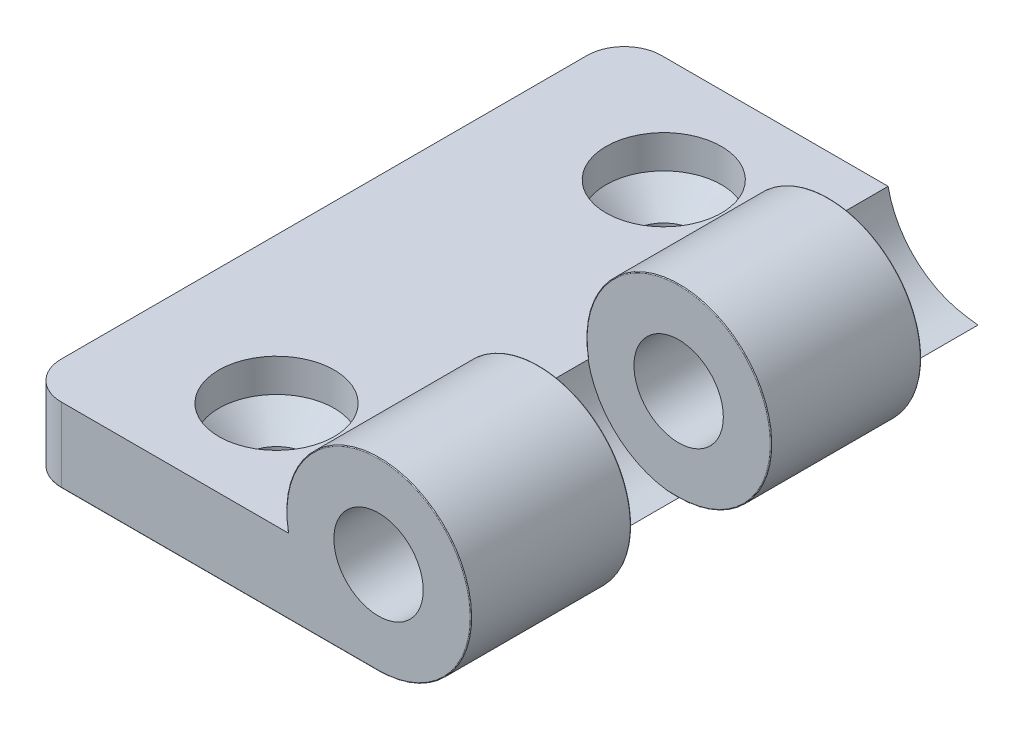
ISO-10303-21;
HEADER;
FILE_DESCRIPTION(('STEP AP214'),'2;1');
FILE_NAME('part.step','',(''),(''),'','','');
FILE_SCHEMA(('AUTOMOTIVE_DESIGN { 1 0 10303 214 1 1 1 1 }'));
ENDSEC;
DATA;
#1=APPLICATION_CONTEXT('core data for automotive mechanical design processes');
#2=APPLICATION_PROTOCOL_DEFINITION('international standard','automotive_design',2000,#1);
#3=PRODUCT_CONTEXT('',#1,'mechanical');
#4=PRODUCT('Part','Part','',(#3));
#5=PRODUCT_RELATED_PRODUCT_CATEGORY('part','',(#4));
#6=PRODUCT_DEFINITION_FORMATION('','',#4);
#7=PRODUCT_DEFINITION_CONTEXT('part definition',#1,'design');
#8=PRODUCT_DEFINITION('design','',#6,#7);
#9=PRODUCT_DEFINITION_SHAPE('','',#8);
#10=(LENGTH_UNIT() NAMED_UNIT(*) SI_UNIT(.MILLI.,.METRE.));
#11=(NAMED_UNIT(*) PLANE_ANGLE_UNIT() SI_UNIT($,.RADIAN.));
#12=(NAMED_UNIT(*) SI_UNIT($,.STERADIAN.) SOLID_ANGLE_UNIT());
#13=UNCERTAINTY_MEASURE_WITH_UNIT(LENGTH_MEASURE(1.E-05),#10,'distance_accuracy_value','');
#14=(GEOMETRIC_REPRESENTATION_CONTEXT(3) GLOBAL_UNCERTAINTY_ASSIGNED_CONTEXT((#13)) GLOBAL_UNIT_ASSIGNED_CONTEXT((#10,
#11,#12)) REPRESENTATION_CONTEXT('',''));
#15=CARTESIAN_POINT('',(0.,0.,0.));
#16=DIRECTION('',(0.,0.,1.));
#17=DIRECTION('',(1.,0.,0.));
#18=AXIS2_PLACEMENT_3D('',#15,#16,#17);
#19=CARTESIAN_POINT('',(0.,0.,40.3));
#20=DIRECTION('',(0.,0.,-1.));
#21=DIRECTION('',(-1.,0.,0.));
#22=AXIS2_PLACEMENT_3D('',#19,#20,#21);
#23=CYLINDRICAL_SURFACE('',#22,6.2);
#24=DIRECTION('',(0.,0.,-1.));
#25=VECTOR('',#24,1.);
#26=CARTESIAN_POINT('',(0.,-6.2,40.3));
#27=LINE('',#26,#25);
#28=CARTESIAN_POINT('',(0.,-6.2,20.1));
#29=VERTEX_POINT('',#28);
#30=CARTESIAN_POINT('',(0.,-6.2,10.125));
#31=VERTEX_POINT('',#30);
#32=EDGE_CURVE('E237',#29,#31,#27,.T.);
#33=ORIENTED_EDGE('',*,*,#32,.T.);
#34=CARTESIAN_POINT('',(0.,0.,10.125));
#35=DIRECTION('',(0.,0.,1.));
#36=DIRECTION('',(1.,0.,0.));
#37=AXIS2_PLACEMENT_3D('',#34,#35,#36);
#38=CIRCLE('',#37,6.2);
#39=CARTESIAN_POINT('',(-6.08276253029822,-1.2,10.125));
#40=VERTEX_POINT('',#39);
#41=EDGE_CURVE('E319',#31,#40,#38,.T.);
#42=ORIENTED_EDGE('',*,*,#41,.T.);
#43=DIRECTION('',(0.,0.,-1.));
#44=VECTOR('',#43,1.);
#45=CARTESIAN_POINT('',(-6.08276253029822,-1.2,40.3));
#46=LINE('',#45,#44);
#47=CARTESIAN_POINT('',(-6.08276253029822,-1.2,20.1));
#48=VERTEX_POINT('',#47);
#49=EDGE_CURVE('E240',#48,#40,#46,.T.);
#50=ORIENTED_EDGE('',*,*,#49,.F.);
#51=CARTESIAN_POINT('',(0.,0.,20.1));
#52=DIRECTION('',(0.,0.,1.));
#53=DIRECTION('',(1.,0.,0.));
#54=AXIS2_PLACEMENT_3D('',#51,#52,#53);
#55=CIRCLE('',#54,6.2);
#56=EDGE_CURVE('E471',#48,#29,#55,.F.);
#57=ORIENTED_EDGE('',*,*,#56,.T.);
#58=EDGE_LOOP('',(#33,#42,#50,#57));
#59=FACE_BOUND('',#58,.T.);
#60=ADVANCED_FACE('F38',(#59),#23,.T.);
#61=CARTESIAN_POINT('',(0.,0.,40.3));
#62=DIRECTION('',(0.,0.,-1.));
#63=DIRECTION('',(-1.,0.,0.));
#64=AXIS2_PLACEMENT_3D('',#61,#62,#63);
#65=CYLINDRICAL_SURFACE('',#64,3.);
#66=CARTESIAN_POINT('',(0.,0.,10.075));
#67=DIRECTION('',(0.,0.,1.));
#68=DIRECTION('',(1.,0.,0.));
#69=AXIS2_PLACEMENT_3D('',#66,#67,#68);
#70=CIRCLE('',#69,3.);
#71=CARTESIAN_POINT('',(3.,0.,10.075));
#72=VERTEX_POINT('',#71);
#73=EDGE_CURVE('E208',#72,#72,#70,.T.);
#74=ORIENTED_EDGE('',*,*,#73,.F.);
#75=EDGE_LOOP('',(#74));
#76=FACE_BOUND('',#75,.T.);
#77=CARTESIAN_POINT('',(0.,0.,20.15));
#78=DIRECTION('',(0.,0.,1.));
#79=DIRECTION('',(1.,0.,0.));
#80=AXIS2_PLACEMENT_3D('',#77,#78,#79);
#81=CIRCLE('',#80,3.);
#82=CARTESIAN_POINT('',(3.,0.,20.15));
#83=VERTEX_POINT('',#82);
#84=EDGE_CURVE('E203',#83,#83,#81,.T.);
#85=ORIENTED_EDGE('',*,*,#84,.T.);
#86=EDGE_LOOP('',(#85));
#87=FACE_BOUND('',#86,.T.);
#88=ADVANCED_FACE('F394',(#76,#87),#65,.F.);
#89=CARTESIAN_POINT('',(0.,0.,0.));
#90=DIRECTION('',(0.,0.,1.));
#91=DIRECTION('',(1.,0.,0.));
#92=AXIS2_PLACEMENT_3D('',#89,#90,#91);
#93=PLANE('',#92);
#94=CARTESIAN_POINT('',(0.,0.,0.));
#95=DIRECTION('',(0.,0.,1.));
#96=DIRECTION('',(1.,0.,0.));
#97=AXIS2_PLACEMENT_3D('',#94,#95,#96);
#98=CIRCLE('',#97,6.2);
#99=CARTESIAN_POINT('',(-6.08276253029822,-1.2,0.));
#100=VERTEX_POINT('',#99);
#101=CARTESIAN_POINT('',(-0.785811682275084,-6.15,0.));
#102=VERTEX_POINT('',#101);
#103=EDGE_CURVE('E196',#100,#102,#98,.T.);
#104=ORIENTED_EDGE('',*,*,#103,.T.);
#105=DIRECTION('',(1.,0.,0.));
#106=VECTOR('',#105,1.);
#107=CARTESIAN_POINT('',(0.,-6.15,0.));
#108=LINE('',#107,#106);
#109=CARTESIAN_POINT('',(-21.3,-6.15,0.));
#110=VERTEX_POINT('',#109);
#111=EDGE_CURVE('E362',#102,#110,#108,.F.);
#112=ORIENTED_EDGE('',*,*,#111,.T.);
#113=DIRECTION('',(0.,-1.,0.));
#114=VECTOR('',#113,1.);
#115=CARTESIAN_POINT('',(-21.3,0.,0.));
#116=LINE('',#115,#114);
#117=CARTESIAN_POINT('',(-21.3,-1.2,0.));
#118=VERTEX_POINT('',#117);
#119=EDGE_CURVE('E267',#110,#118,#116,.F.);
#120=ORIENTED_EDGE('',*,*,#119,.T.);
#121=DIRECTION('',(-1.,0.,0.));
#122=VECTOR('',#121,1.);
#123=CARTESIAN_POINT('',(0.,-1.2,0.));
#124=LINE('',#123,#122);
#125=EDGE_CURVE('E227',#100,#118,#124,.T.);
#126=ORIENTED_EDGE('',*,*,#125,.F.);
#127=EDGE_LOOP('',(#104,#112,#120,#126));
#128=FACE_BOUND('',#127,.T.);
#129=ADVANCED_FACE('F402',(#128),#93,.F.);
#130=CARTESIAN_POINT('',(0.,0.,40.3));
#131=DIRECTION('',(0.,0.,1.));
#132=DIRECTION('',(1.,0.,0.));
#133=AXIS2_PLACEMENT_3D('',#130,#131,#132);
#134=PLANE('',#133);
#135=DIRECTION('',(0.,-1.,0.));
#136=VECTOR('',#135,1.);
#137=CARTESIAN_POINT('',(-21.3,-6.2,40.3));
#138=LINE('',#137,#136);
#139=CARTESIAN_POINT('',(-21.3,-1.2,40.3));
#140=VERTEX_POINT('',#139);
#141=CARTESIAN_POINT('',(-21.3,-6.15,40.3));
#142=VERTEX_POINT('',#141);
#143=EDGE_CURVE('E258',#140,#142,#138,.T.);
#144=ORIENTED_EDGE('',*,*,#143,.T.);
#145=DIRECTION('',(1.,0.,0.));
#146=VECTOR('',#145,1.);
#147=CARTESIAN_POINT('',(0.,-6.15,40.3));
#148=LINE('',#147,#146);
#149=CARTESIAN_POINT('',(0.,-6.15,40.3));
#150=VERTEX_POINT('',#149);
#151=EDGE_CURVE('E62',#142,#150,#148,.T.);
#152=ORIENTED_EDGE('',*,*,#151,.T.);
#153=CARTESIAN_POINT('',(0.,0.,40.3));
#154=DIRECTION('',(0.,0.,1.));
#155=DIRECTION('',(1.,0.,0.));
#156=AXIS2_PLACEMENT_3D('',#153,#154,#155);
#157=CIRCLE('',#156,6.15);
#158=CARTESIAN_POINT('',(-6.03179077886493,-1.2,40.3));
#159=VERTEX_POINT('',#158);
#160=EDGE_CURVE('E425',#150,#159,#157,.T.);
#161=ORIENTED_EDGE('',*,*,#160,.T.);
#162=DIRECTION('',(-1.,0.,0.));
#163=VECTOR('',#162,1.);
#164=CARTESIAN_POINT('',(0.,-1.2,40.3));
#165=LINE('',#164,#163);
#166=EDGE_CURVE('E228',#159,#140,#165,.T.);
#167=ORIENTED_EDGE('',*,*,#166,.T.);
#168=EDGE_LOOP('',(#144,#152,#161,#167));
#169=FACE_BOUND('',#168,.T.);
#170=CARTESIAN_POINT('',(0.,0.,40.3));
#171=DIRECTION('',(0.,0.,1.));
#172=DIRECTION('',(1.,0.,0.));
#173=AXIS2_PLACEMENT_3D('',#170,#171,#172);
#174=CIRCLE('',#173,3.);
#175=CARTESIAN_POINT('',(3.,0.,40.3));
#176=VERTEX_POINT('',#175);
#177=EDGE_CURVE('E243',#176,#176,#174,.T.);
#178=ORIENTED_EDGE('',*,*,#177,.F.);
#179=EDGE_LOOP('',(#178));
#180=FACE_BOUND('',#179,.T.);
#181=ADVANCED_FACE('F409',(#169,#180),#134,.T.);
#182=CARTESIAN_POINT('',(-6.08276253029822,-1.2,40.25));
#183=VERTEX_POINT('',#182);
#184=CARTESIAN_POINT('',(-6.08276253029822,-1.2,29.6));
#185=VERTEX_POINT('',#184);
#186=EDGE_CURVE('E241',#183,#185,#46,.T.);
#187=ORIENTED_EDGE('',*,*,#186,.F.);
#188=CARTESIAN_POINT('',(0.,0.,40.25));
#189=DIRECTION('',(0.,0.,1.));
#190=DIRECTION('',(1.,0.,0.));
#191=AXIS2_PLACEMENT_3D('',#188,#189,#190);
#192=CIRCLE('',#191,6.2);
#193=CARTESIAN_POINT('',(0.,-6.2,40.25));
#194=VERTEX_POINT('',#193);
#195=EDGE_CURVE('E48',#183,#194,#192,.F.);
#196=ORIENTED_EDGE('',*,*,#195,.T.);
#197=CARTESIAN_POINT('',(0.,-6.2,29.6));
#198=VERTEX_POINT('',#197);
#199=EDGE_CURVE('E233',#194,#198,#27,.T.);
#200=ORIENTED_EDGE('',*,*,#199,.T.);
#201=CARTESIAN_POINT('',(0.,0.,29.6));
#202=DIRECTION('',(0.,0.,1.));
#203=DIRECTION('',(1.,0.,0.));
#204=AXIS2_PLACEMENT_3D('',#201,#202,#203);
#205=CIRCLE('',#204,6.2);
#206=EDGE_CURVE('E271',#198,#185,#205,.T.);
#207=ORIENTED_EDGE('',*,*,#206,.T.);
#208=EDGE_LOOP('',(#187,#196,#200,#207));
#209=FACE_BOUND('',#208,.T.);
#210=ADVANCED_FACE('F397',(#209),#23,.T.);
#211=CARTESIAN_POINT('',(0.,0.,29.55));
#212=DIRECTION('',(0.,0.,1.));
#213=DIRECTION('',(1.,0.,0.));
#214=AXIS2_PLACEMENT_3D('',#211,#212,#213);
#215=CIRCLE('',#214,3.);
#216=CARTESIAN_POINT('',(3.,0.,29.55));
#217=VERTEX_POINT('',#216);
#218=EDGE_CURVE('E197',#217,#217,#215,.T.);
#219=ORIENTED_EDGE('',*,*,#218,.F.);
#220=EDGE_LOOP('',(#219));
#221=FACE_BOUND('',#220,.T.);
#222=ORIENTED_EDGE('',*,*,#177,.T.);
#223=EDGE_LOOP('',(#222));
#224=FACE_BOUND('',#223,.T.);
#225=ADVANCED_FACE('F404',(#221,#224),#65,.F.);
#226=CARTESIAN_POINT('',(0.,-1.2,40.3));
#227=DIRECTION('',(0.,-1.,0.));
#228=DIRECTION('',(1.,0.,0.));
#229=AXIS2_PLACEMENT_3D('',#226,#227,#228);
#230=PLANE('',#229);
#231=CARTESIAN_POINT('',(-14.,-1.2,33.15));
#232=DIRECTION('',(0.,1.,0.));
#233=DIRECTION('',(-1.,0.,0.));
#234=AXIS2_PLACEMENT_3D('',#231,#232,#233);
#235=CIRCLE('',#234,3.875);
#236=CARTESIAN_POINT('',(-17.875,-1.2,33.15));
#237=VERTEX_POINT('',#236);
#238=EDGE_CURVE('E218',#237,#237,#235,.T.);
#239=ORIENTED_EDGE('',*,*,#238,.F.);
#240=EDGE_LOOP('',(#239));
#241=FACE_BOUND('',#240,.T.);
#242=CARTESIAN_POINT('',(-14.,-1.2,7.15));
#243=DIRECTION('',(0.,1.,0.));
#244=DIRECTION('',(-1.,0.,0.));
#245=AXIS2_PLACEMENT_3D('',#242,#243,#244);
#246=CIRCLE('',#245,3.875);
#247=CARTESIAN_POINT('',(-17.875,-1.2,7.15));
#248=VERTEX_POINT('',#247);
#249=EDGE_CURVE('E224',#248,#248,#246,.T.);
#250=ORIENTED_EDGE('',*,*,#249,.F.);
#251=EDGE_LOOP('',(#250));
#252=FACE_BOUND('',#251,.T.);
#253=ORIENTED_EDGE('',*,*,#125,.T.);
#254=CARTESIAN_POINT('',(-21.3,-1.2,2.5));
#255=DIRECTION('',(0.,-1.,0.));
#256=DIRECTION('',(1.,0.,0.));
#257=AXIS2_PLACEMENT_3D('',#254,#255,#256);
#258=CIRCLE('',#257,2.5);
#259=CARTESIAN_POINT('',(-23.8,-1.2,2.5));
#260=VERTEX_POINT('',#259);
#261=EDGE_CURVE('E269',#118,#260,#258,.F.);
#262=ORIENTED_EDGE('',*,*,#261,.T.);
#263=DIRECTION('',(0.,0.,-1.));
#264=VECTOR('',#263,1.);
#265=CARTESIAN_POINT('',(-23.8,-1.2,40.3));
#266=LINE('',#265,#264);
#267=CARTESIAN_POINT('',(-23.8,-1.2,37.8));
#268=VERTEX_POINT('',#267);
#269=EDGE_CURVE('E235',#268,#260,#266,.T.);
#270=ORIENTED_EDGE('',*,*,#269,.F.);
#271=CARTESIAN_POINT('',(-21.3,-1.2,37.8));
#272=DIRECTION('',(0.,-1.,0.));
#273=DIRECTION('',(1.,0.,0.));
#274=AXIS2_PLACEMENT_3D('',#271,#272,#273);
#275=CIRCLE('',#274,2.5);
#276=EDGE_CURVE('E262',#268,#140,#275,.F.);
#277=ORIENTED_EDGE('',*,*,#276,.T.);
#278=ORIENTED_EDGE('',*,*,#166,.F.);
#279=CARTESIAN_POINT('',(-6.03179077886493,-1.2,40.3));
#280=CARTESIAN_POINT('',(-6.03469958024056,-1.2,40.3000022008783));
#281=CARTESIAN_POINT('',(-6.03760800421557,-1.2,40.2997559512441));
#282=CARTESIAN_POINT('',(-6.04334260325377,-1.2,40.2987822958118));
#283=CARTESIAN_POINT('',(-6.04616879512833,-1.2,40.2980549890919));
#284=CARTESIAN_POINT('',(-6.05166056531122,-1.2,40.2961343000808));
#285=CARTESIAN_POINT('',(-6.05432603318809,-1.2,40.2949406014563));
#286=CARTESIAN_POINT('',(-6.05941543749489,-1.2,40.2921191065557));
#287=CARTESIAN_POINT('',(-6.06183945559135,-1.2,40.2904914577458));
#288=CARTESIAN_POINT('',(-6.06635276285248,-1.2,40.2868621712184));
#289=CARTESIAN_POINT('',(-6.06844491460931,-1.2,40.2848640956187));
#290=CARTESIAN_POINT('',(-6.07225690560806,-1.2,40.2805386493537));
#291=CARTESIAN_POINT('',(-6.07397668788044,-1.2,40.2782112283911));
#292=CARTESIAN_POINT('',(-6.07696092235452,-1.2,40.2733392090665));
#293=CARTESIAN_POINT('',(-6.07823307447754,-1.2,40.2707993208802));
#294=CARTESIAN_POINT('',(-6.08032363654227,-1.2,40.2655402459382));
#295=CARTESIAN_POINT('',(-6.0811424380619,-1.2,40.2628212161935));
#296=CARTESIAN_POINT('',(-6.08206759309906,-1.2,40.2584007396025));
#297=CARTESIAN_POINT('',(-6.08232804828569,-1.2,40.2567300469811));
#298=CARTESIAN_POINT('',(-6.08267546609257,-1.2,40.2533731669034));
#299=CARTESIAN_POINT('',(-6.08276267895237,-1.2,40.2516870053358));
#300=CARTESIAN_POINT('',(-6.08276253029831,-1.2,40.25));
#301=B_SPLINE_CURVE_WITH_KNOTS('',3,(#279,#280,#281,#282,#283,#284,#285,#286,#287,#288,#289,
#290,#291,#292,#293,#294,#295,#296,#297,#298,#299,#300),.UNSPECIFIED.,.F.,.F.,(4,2,2,2,2,2,2,2,
2,2,4),(0.,0.00871552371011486,0.017429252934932,0.0261489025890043,0.0348655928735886,
0.0435024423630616,0.0521406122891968,0.0606219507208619,0.0690959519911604,0.0741603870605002,
0.0792175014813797),.UNSPECIFIED.);
#302=EDGE_CURVE('E11',#159,#183,#301,.T.);
#303=ORIENTED_EDGE('',*,*,#302,.T.);
#304=ORIENTED_EDGE('',*,*,#186,.T.);
#305=CARTESIAN_POINT('',(-6.08276253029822,-1.2,29.6));
#306=CARTESIAN_POINT('',(-6.08276513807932,-1.2,29.5972256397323));
#307=CARTESIAN_POINT('',(-6.08252733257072,-1.2,29.5944523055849));
#308=CARTESIAN_POINT('',(-6.08159051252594,-1.2,29.5889882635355));
#309=CARTESIAN_POINT('',(-6.08089210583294,-1.2,29.586297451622));
#310=CARTESIAN_POINT('',(-6.0790533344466,-1.2,29.5810705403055));
#311=CARTESIAN_POINT('',(-6.07791283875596,-1.2,29.5785344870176));
#312=CARTESIAN_POINT('',(-6.07522590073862,-1.2,29.5736878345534));
#313=CARTESIAN_POINT('',(-6.07367946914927,-1.2,29.571377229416));
#314=CARTESIAN_POINT('',(-6.07021241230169,-1.2,29.5670253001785));
#315=CARTESIAN_POINT('',(-6.06828882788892,-1.2,29.5649863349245));
#316=CARTESIAN_POINT('',(-6.06413169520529,-1.2,29.5612530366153));
#317=CARTESIAN_POINT('',(-6.06189807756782,-1.2,29.5595587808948));
#318=CARTESIAN_POINT('',(-6.05714176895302,-1.2,29.5565307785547));
#319=CARTESIAN_POINT('',(-6.05461458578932,-1.2,29.5552040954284));
#320=CARTESIAN_POINT('',(-6.04937629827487,-1.2,29.5529860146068));
#321=CARTESIAN_POINT('',(-6.04666525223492,-1.2,29.552094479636));
#322=CARTESIAN_POINT('',(-6.04191818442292,-1.2,29.5509556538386));
#323=CARTESIAN_POINT('',(-6.03990799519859,-1.2,29.5505974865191));
#324=CARTESIAN_POINT('',(-6.03586235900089,-1.2,29.5501196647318));
#325=CARTESIAN_POINT('',(-6.033826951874,-1.2,29.5499996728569));
#326=CARTESIAN_POINT('',(-6.03179077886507,-1.2,29.5499999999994));
#327=B_SPLINE_CURVE_WITH_KNOTS('',3,(#305,#306,#307,#308,#309,#310,#311,#312,#313,#314,#315,
#316,#317,#318,#319,#320,#321,#322,#323,#324,#325,#326),.UNSPECIFIED.,.F.,.F.,(4,2,2,2,2,2,2,2,
2,2,4),(0.,0.00831137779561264,0.0166118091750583,0.0249147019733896,0.0332173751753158,
0.0415880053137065,0.0499605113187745,0.0584842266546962,0.0670052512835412,0.0731174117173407,
0.0792209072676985),.UNSPECIFIED.);
#328=CARTESIAN_POINT('',(-6.03179077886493,-1.2,29.55));
#329=VERTEX_POINT('',#328);
#330=EDGE_CURVE('E280',#185,#329,#327,.T.);
#331=ORIENTED_EDGE('',*,*,#330,.T.);
#332=DIRECTION('',(1.,0.,0.));
#333=VECTOR('',#332,1.);
#334=CARTESIAN_POINT('',(0.,-1.2,29.55));
#335=LINE('',#334,#333);
#336=CARTESIAN_POINT('',(-6.08276253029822,-1.2,29.55));
#337=VERTEX_POINT('',#336);
#338=EDGE_CURVE('E194',#337,#329,#335,.T.);
#339=ORIENTED_EDGE('',*,*,#338,.F.);
#340=DIRECTION('',(0.,0.,-1.));
#341=VECTOR('',#340,1.);
#342=CARTESIAN_POINT('',(-6.08276253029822,-1.2,29.55));
#343=LINE('',#342,#341);
#344=CARTESIAN_POINT('',(-6.08276253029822,-1.2,20.15));
#345=VERTEX_POINT('',#344);
#346=EDGE_CURVE('E185',#345,#337,#343,.F.);
#347=ORIENTED_EDGE('',*,*,#346,.F.);
#348=DIRECTION('',(-1.,0.,0.));
#349=VECTOR('',#348,1.);
#350=CARTESIAN_POINT('',(0.,-1.2,20.15));
#351=LINE('',#350,#349);
#352=CARTESIAN_POINT('',(-6.03179077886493,-1.2,20.15));
#353=VERTEX_POINT('',#352);
#354=EDGE_CURVE('E169',#353,#345,#351,.T.);
#355=ORIENTED_EDGE('',*,*,#354,.F.);
#356=CARTESIAN_POINT('',(-6.03179077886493,-1.2,20.15));
#357=CARTESIAN_POINT('',(-6.03469958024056,-1.2,20.1500022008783));
#358=CARTESIAN_POINT('',(-6.03760800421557,-1.2,20.1497559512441));
#359=CARTESIAN_POINT('',(-6.04334260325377,-1.2,20.1487822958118));
#360=CARTESIAN_POINT('',(-6.04616879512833,-1.2,20.1480549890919));
#361=CARTESIAN_POINT('',(-6.05166056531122,-1.2,20.1461343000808));
#362=CARTESIAN_POINT('',(-6.05432603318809,-1.2,20.1449406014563));
#363=CARTESIAN_POINT('',(-6.05941543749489,-1.2,20.1421191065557));
#364=CARTESIAN_POINT('',(-6.06183945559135,-1.2,20.1404914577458));
#365=CARTESIAN_POINT('',(-6.06635276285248,-1.2,20.1368621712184));
#366=CARTESIAN_POINT('',(-6.06844491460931,-1.2,20.1348640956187));
#367=CARTESIAN_POINT('',(-6.07225690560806,-1.2,20.1305386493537));
#368=CARTESIAN_POINT('',(-6.07397668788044,-1.2,20.1282112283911));
#369=CARTESIAN_POINT('',(-6.07696092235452,-1.2,20.1233392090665));
#370=CARTESIAN_POINT('',(-6.07823307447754,-1.2,20.1207993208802));
#371=CARTESIAN_POINT('',(-6.08032363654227,-1.2,20.1155402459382));
#372=CARTESIAN_POINT('',(-6.0811424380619,-1.2,20.1128212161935));
#373=CARTESIAN_POINT('',(-6.08206759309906,-1.2,20.1084007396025));
#374=CARTESIAN_POINT('',(-6.0823280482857,-1.2,20.1067300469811));
#375=CARTESIAN_POINT('',(-6.08267546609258,-1.2,20.1033731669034));
#376=CARTESIAN_POINT('',(-6.08276267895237,-1.2,20.1016870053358));
#377=CARTESIAN_POINT('',(-6.08276253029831,-1.2,20.1));
#378=B_SPLINE_CURVE_WITH_KNOTS('',3,(#356,#357,#358,#359,#360,#361,#362,#363,#364,#365,#366,
#367,#368,#369,#370,#371,#372,#373,#374,#375,#376,#377),.UNSPECIFIED.,.F.,.F.,(4,2,2,2,2,2,2,2,
2,2,4),(0.,0.00871552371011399,0.017429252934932,0.0261489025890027,0.034865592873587,
0.0435024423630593,0.0521406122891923,0.0606219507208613,0.06909595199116,0.0741603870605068,
0.0792175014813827),.UNSPECIFIED.);
#379=EDGE_CURVE('E320',#353,#48,#378,.T.);
#380=ORIENTED_EDGE('',*,*,#379,.T.);
#381=ORIENTED_EDGE('',*,*,#49,.T.);
#382=CARTESIAN_POINT('',(-6.08276253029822,-1.2,10.125));
#383=CARTESIAN_POINT('',(-6.08276513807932,-1.2,10.1222256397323));
#384=CARTESIAN_POINT('',(-6.08252733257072,-1.2,10.1194523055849));
#385=CARTESIAN_POINT('',(-6.08159051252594,-1.2,10.1139882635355));
#386=CARTESIAN_POINT('',(-6.08089210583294,-1.2,10.111297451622));
#387=CARTESIAN_POINT('',(-6.0790533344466,-1.2,10.1060705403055));
#388=CARTESIAN_POINT('',(-6.07791283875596,-1.2,10.1035344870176));
#389=CARTESIAN_POINT('',(-6.07522590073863,-1.2,10.0986878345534));
#390=CARTESIAN_POINT('',(-6.07367946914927,-1.2,10.096377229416));
#391=CARTESIAN_POINT('',(-6.07021241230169,-1.2,10.0920253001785));
#392=CARTESIAN_POINT('',(-6.06828882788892,-1.2,10.0899863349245));
#393=CARTESIAN_POINT('',(-6.06413169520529,-1.2,10.0862530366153));
#394=CARTESIAN_POINT('',(-6.06189807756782,-1.2,10.0845587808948));
#395=CARTESIAN_POINT('',(-6.05714176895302,-1.2,10.0815307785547));
#396=CARTESIAN_POINT('',(-6.05461458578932,-1.2,10.0802040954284));
#397=CARTESIAN_POINT('',(-6.04937629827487,-1.2,10.0779860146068));
#398=CARTESIAN_POINT('',(-6.04666525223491,-1.2,10.077094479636));
#399=CARTESIAN_POINT('',(-6.04191818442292,-1.2,10.0759556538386));
#400=CARTESIAN_POINT('',(-6.03990799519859,-1.2,10.0755974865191));
#401=CARTESIAN_POINT('',(-6.03586235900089,-1.2,10.0751196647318));
#402=CARTESIAN_POINT('',(-6.033826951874,-1.2,10.0749996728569));
#403=CARTESIAN_POINT('',(-6.03179077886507,-1.2,10.0749999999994));
#404=B_SPLINE_CURVE_WITH_KNOTS('',3,(#382,#383,#384,#385,#386,#387,#388,#389,#390,#391,#392,
#393,#394,#395,#396,#397,#398,#399,#400,#401,#402,#403),.UNSPECIFIED.,.F.,.F.,(4,2,2,2,2,2,2,2,
2,2,4),(0.,0.00831137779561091,0.0166118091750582,0.0249147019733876,0.0332173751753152,
0.0415880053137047,0.0499605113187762,0.0584842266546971,0.0670052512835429,0.0731174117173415,
0.0792209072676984),.UNSPECIFIED.);
#405=CARTESIAN_POINT('',(-6.03179077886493,-1.2,10.075));
#406=VERTEX_POINT('',#405);
#407=EDGE_CURVE('E703',#40,#406,#404,.T.);
#408=ORIENTED_EDGE('',*,*,#407,.T.);
#409=DIRECTION('',(1.,0.,0.));
#410=VECTOR('',#409,1.);
#411=CARTESIAN_POINT('',(0.,-1.2,10.075));
#412=LINE('',#411,#410);
#413=CARTESIAN_POINT('',(-6.08276253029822,-1.2,10.075));
#414=VERTEX_POINT('',#413);
#415=EDGE_CURVE('E706',#414,#406,#412,.T.);
#416=ORIENTED_EDGE('',*,*,#415,.F.);
#417=DIRECTION('',(0.,0.,-1.));
#418=VECTOR('',#417,1.);
#419=CARTESIAN_POINT('',(-6.08276253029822,-1.2,10.075));
#420=LINE('',#419,#418);
#421=EDGE_CURVE('E212',#100,#414,#420,.F.);
#422=ORIENTED_EDGE('',*,*,#421,.F.);
#423=EDGE_LOOP('',(#253,#262,#270,#277,#278,#303,#304,#331,#339,#347,#355,#380,#381,#408,#416,#422));
#424=FACE_BOUND('',#423,.T.);
#425=ADVANCED_FACE('F192',(#241,#252,#424),#230,.F.);
#426=CARTESIAN_POINT('',(-23.8,-6.2,40.3));
#427=DIRECTION('',(1.,0.,0.));
#428=DIRECTION('',(0.,0.,-1.));
#429=AXIS2_PLACEMENT_3D('',#426,#427,#428);
#430=PLANE('',#429);
#431=DIRECTION('',(0.,-1.,0.));
#432=VECTOR('',#431,1.);
#433=CARTESIAN_POINT('',(-23.8,-6.2,2.5));
#434=LINE('',#433,#432);
#435=CARTESIAN_POINT('',(-23.8,-6.15,2.5));
#436=VERTEX_POINT('',#435);
#437=EDGE_CURVE('E264',#260,#436,#434,.T.);
#438=ORIENTED_EDGE('',*,*,#437,.T.);
#439=DIRECTION('',(0.,0.,-1.));
#440=VECTOR('',#439,1.);
#441=CARTESIAN_POINT('',(-23.8,-6.15,40.3));
#442=LINE('',#441,#440);
#443=CARTESIAN_POINT('',(-23.8,-6.15,37.8));
#444=VERTEX_POINT('',#443);
#445=EDGE_CURVE('E726',#436,#444,#442,.F.);
#446=ORIENTED_EDGE('',*,*,#445,.T.);
#447=DIRECTION('',(0.,-1.,0.));
#448=VECTOR('',#447,1.);
#449=CARTESIAN_POINT('',(-23.8,-1.2,37.8));
#450=LINE('',#449,#448);
#451=EDGE_CURVE('E260',#444,#268,#450,.F.);
#452=ORIENTED_EDGE('',*,*,#451,.T.);
#453=ORIENTED_EDGE('',*,*,#269,.T.);
#454=EDGE_LOOP('',(#438,#446,#452,#453));
#455=FACE_BOUND('',#454,.T.);
#456=ADVANCED_FACE('F617',(#455),#430,.F.);
#457=CARTESIAN_POINT('',(0.,-6.2,40.3));
#458=DIRECTION('',(0.,1.,0.));
#459=DIRECTION('',(-1.,0.,0.));
#460=AXIS2_PLACEMENT_3D('',#457,#458,#459);
#461=PLANE('',#460);
#462=CARTESIAN_POINT('',(-14.,-6.20000000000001,33.15));
#463=DIRECTION('',(0.,1.,0.));
#464=DIRECTION('',(-1.,0.,0.));
#465=AXIS2_PLACEMENT_3D('',#462,#463,#464);
#466=CIRCLE('',#465,2.1);
#467=CARTESIAN_POINT('',(-16.1,-6.20000000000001,33.15));
#468=VERTEX_POINT('',#467);
#469=EDGE_CURVE('E215',#468,#468,#466,.T.);
#470=ORIENTED_EDGE('',*,*,#469,.T.);
#471=EDGE_LOOP('',(#470));
#472=FACE_BOUND('',#471,.T.);
#473=CARTESIAN_POINT('',(-14.,-6.20000000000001,7.15));
#474=DIRECTION('',(0.,1.,0.));
#475=DIRECTION('',(-1.,0.,0.));
#476=AXIS2_PLACEMENT_3D('',#473,#474,#475);
#477=CIRCLE('',#476,2.1);
#478=CARTESIAN_POINT('',(-16.1,-6.20000000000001,7.15));
#479=VERTEX_POINT('',#478);
#480=EDGE_CURVE('E221',#479,#479,#477,.T.);
#481=ORIENTED_EDGE('',*,*,#480,.T.);
#482=EDGE_LOOP('',(#481));
#483=FACE_BOUND('',#482,.T.);
#484=CARTESIAN_POINT('',(-21.3,-6.2,2.5));
#485=DIRECTION('',(0.,1.,0.));
#486=DIRECTION('',(-1.,0.,0.));
#487=AXIS2_PLACEMENT_3D('',#484,#485,#486);
#488=CIRCLE('',#487,2.45);
#489=CARTESIAN_POINT('',(-23.75,-6.2,2.5));
#490=VERTEX_POINT('',#489);
#491=CARTESIAN_POINT('',(-21.3,-6.2,0.0500000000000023));
#492=VERTEX_POINT('',#491);
#493=EDGE_CURVE('E456',#490,#492,#488,.F.);
#494=ORIENTED_EDGE('',*,*,#493,.T.);
#495=DIRECTION('',(1.,0.,0.));
#496=VECTOR('',#495,1.);
#497=CARTESIAN_POINT('',(0.,-6.2,0.0500000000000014));
#498=LINE('',#497,#496);
#499=CARTESIAN_POINT('',(0.,-6.2,0.0500000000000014));
#500=VERTEX_POINT('',#499);
#501=EDGE_CURVE('E363',#492,#500,#498,.T.);
#502=ORIENTED_EDGE('',*,*,#501,.T.);
#503=EDGE_CURVE('E231',#31,#500,#27,.T.);
#504=ORIENTED_EDGE('',*,*,#503,.F.);
#505=ORIENTED_EDGE('',*,*,#32,.F.);
#506=EDGE_CURVE('E236',#198,#29,#27,.T.);
#507=ORIENTED_EDGE('',*,*,#506,.F.);
#508=ORIENTED_EDGE('',*,*,#199,.F.);
#509=DIRECTION('',(1.,0.,0.));
#510=VECTOR('',#509,1.);
#511=CARTESIAN_POINT('',(-21.3,-6.2,40.25));
#512=LINE('',#511,#510);
#513=CARTESIAN_POINT('',(-21.3,-6.2,40.25));
#514=VERTEX_POINT('',#513);
#515=EDGE_CURVE('E451',#194,#514,#512,.F.);
#516=ORIENTED_EDGE('',*,*,#515,.T.);
#517=CARTESIAN_POINT('',(-21.3,-6.2,37.8));
#518=DIRECTION('',(0.,1.,0.));
#519=DIRECTION('',(-1.,0.,0.));
#520=AXIS2_PLACEMENT_3D('',#517,#518,#519);
#521=CIRCLE('',#520,2.45);
#522=CARTESIAN_POINT('',(-23.75,-6.2,37.8));
#523=VERTEX_POINT('',#522);
#524=EDGE_CURVE('E453',#514,#523,#521,.F.);
#525=ORIENTED_EDGE('',*,*,#524,.T.);
#526=DIRECTION('',(0.,0.,-1.));
#527=VECTOR('',#526,1.);
#528=CARTESIAN_POINT('',(-23.75,-6.2,40.3));
#529=LINE('',#528,#527);
#530=EDGE_CURVE('E455',#523,#490,#529,.T.);
#531=ORIENTED_EDGE('',*,*,#530,.T.);
#532=EDGE_LOOP('',(#494,#502,#504,#505,#507,#508,#516,#525,#531));
#533=FACE_BOUND('',#532,.T.);
#534=ADVANCED_FACE('F463',(#472,#483,#533),#461,.F.);
#535=CARTESIAN_POINT('',(-14.,-3.2,7.15));
#536=DIRECTION('',(0.,1.,0.));
#537=DIRECTION('',(-1.,0.,0.));
#538=AXIS2_PLACEMENT_3D('',#535,#536,#537);
#539=CYLINDRICAL_SURFACE('',#538,3.875);
#540=CARTESIAN_POINT('',(-14.,-3.42500000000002,7.15));
#541=DIRECTION('',(0.,1.,0.));
#542=DIRECTION('',(0.,0.,1.));
#543=AXIS2_PLACEMENT_3D('',#540,#541,#542);
#544=CIRCLE('',#543,3.875);
#545=CARTESIAN_POINT('',(-14.,-3.42500000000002,11.025));
#546=VERTEX_POINT('',#545);
#547=EDGE_CURVE('E249',#546,#546,#544,.F.);
#548=ORIENTED_EDGE('',*,*,#547,.T.);
#549=EDGE_LOOP('',(#548));
#550=FACE_BOUND('',#549,.T.);
#551=ORIENTED_EDGE('',*,*,#249,.T.);
#552=EDGE_LOOP('',(#551));
#553=FACE_BOUND('',#552,.T.);
#554=ADVANCED_FACE('F602',(#550,#553),#539,.F.);
#555=CARTESIAN_POINT('',(-14.,-6.20000000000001,7.15));
#556=DIRECTION('',(0.,1.,0.));
#557=DIRECTION('',(-1.,0.,0.));
#558=AXIS2_PLACEMENT_3D('',#555,#556,#557);
#559=CYLINDRICAL_SURFACE('',#558,2.1);
#560=CARTESIAN_POINT('',(-14.,-5.20000000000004,7.15));
#561=DIRECTION('',(0.,1.,0.));
#562=DIRECTION('',(0.,0.,1.));
#563=AXIS2_PLACEMENT_3D('',#560,#561,#562);
#564=CIRCLE('',#563,2.1);
#565=CARTESIAN_POINT('',(-14.,-5.20000000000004,9.25));
#566=VERTEX_POINT('',#565);
#567=EDGE_CURVE('E246',#566,#566,#564,.T.);
#568=ORIENTED_EDGE('',*,*,#567,.T.);
#569=EDGE_LOOP('',(#568));
#570=FACE_BOUND('',#569,.T.);
#571=ORIENTED_EDGE('',*,*,#480,.F.);
#572=EDGE_LOOP('',(#571));
#573=FACE_BOUND('',#572,.T.);
#574=ADVANCED_FACE('F595',(#570,#573),#559,.F.);
#575=CARTESIAN_POINT('',(-14.,-5.20000000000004,7.15));
#576=DIRECTION('',(0.,1.,0.));
#577=DIRECTION('',(0.,0.,1.));
#578=AXIS2_PLACEMENT_3D('',#575,#576,#577);
#579=CONICAL_SURFACE('',#578,2.1,0.785398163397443);
#580=ORIENTED_EDGE('',*,*,#547,.F.);
#581=EDGE_LOOP('',(#580));
#582=FACE_BOUND('',#581,.T.);
#583=ORIENTED_EDGE('',*,*,#567,.F.);
#584=EDGE_LOOP('',(#583));
#585=FACE_BOUND('',#584,.T.);
#586=ADVANCED_FACE('F588',(#582,#585),#579,.F.);
#587=CARTESIAN_POINT('',(-14.,-3.2,33.15));
#588=DIRECTION('',(0.,1.,0.));
#589=DIRECTION('',(-1.,0.,0.));
#590=AXIS2_PLACEMENT_3D('',#587,#588,#589);
#591=CYLINDRICAL_SURFACE('',#590,3.875);
#592=CARTESIAN_POINT('',(-14.,-3.42500000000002,33.15));
#593=DIRECTION('',(0.,1.,0.));
#594=DIRECTION('',(0.,0.,1.));
#595=AXIS2_PLACEMENT_3D('',#592,#593,#594);
#596=CIRCLE('',#595,3.875);
#597=CARTESIAN_POINT('',(-14.,-3.42500000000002,37.025));
#598=VERTEX_POINT('',#597);
#599=EDGE_CURVE('E255',#598,#598,#596,.F.);
#600=ORIENTED_EDGE('',*,*,#599,.T.);
#601=EDGE_LOOP('',(#600));
#602=FACE_BOUND('',#601,.T.);
#603=ORIENTED_EDGE('',*,*,#238,.T.);
#604=EDGE_LOOP('',(#603));
#605=FACE_BOUND('',#604,.T.);
#606=ADVANCED_FACE('F581',(#602,#605),#591,.F.);
#607=CARTESIAN_POINT('',(-14.,-6.20000000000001,33.15));
#608=DIRECTION('',(0.,1.,0.));
#609=DIRECTION('',(-1.,0.,0.));
#610=AXIS2_PLACEMENT_3D('',#607,#608,#609);
#611=CYLINDRICAL_SURFACE('',#610,2.1);
#612=CARTESIAN_POINT('',(-14.,-5.20000000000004,33.15));
#613=DIRECTION('',(0.,1.,0.));
#614=DIRECTION('',(0.,0.,1.));
#615=AXIS2_PLACEMENT_3D('',#612,#613,#614);
#616=CIRCLE('',#615,2.1);
#617=CARTESIAN_POINT('',(-14.,-5.20000000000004,35.25));
#618=VERTEX_POINT('',#617);
#619=EDGE_CURVE('E252',#618,#618,#616,.T.);
#620=ORIENTED_EDGE('',*,*,#619,.T.);
#621=EDGE_LOOP('',(#620));
#622=FACE_BOUND('',#621,.T.);
#623=ORIENTED_EDGE('',*,*,#469,.F.);
#624=EDGE_LOOP('',(#623));
#625=FACE_BOUND('',#624,.T.);
#626=ADVANCED_FACE('F344',(#622,#625),#611,.F.);
#627=CARTESIAN_POINT('',(-14.,-5.20000000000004,33.15));
#628=DIRECTION('',(0.,1.,0.));
#629=DIRECTION('',(0.,0.,1.));
#630=AXIS2_PLACEMENT_3D('',#627,#628,#629);
#631=CONICAL_SURFACE('',#630,2.1,0.785398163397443);
#632=ORIENTED_EDGE('',*,*,#599,.F.);
#633=EDGE_LOOP('',(#632));
#634=FACE_BOUND('',#633,.T.);
#635=ORIENTED_EDGE('',*,*,#619,.F.);
#636=EDGE_LOOP('',(#635));
#637=FACE_BOUND('',#636,.T.);
#638=ADVANCED_FACE('F564',(#634,#637),#631,.F.);
#639=CARTESIAN_POINT('',(-21.3,0.,37.8));
#640=DIRECTION('',(0.,1.,0.));
#641=DIRECTION('',(0.,0.,1.));
#642=AXIS2_PLACEMENT_3D('',#639,#640,#641);
#643=CYLINDRICAL_SURFACE('',#642,2.5);
#644=ORIENTED_EDGE('',*,*,#451,.F.);
#645=CARTESIAN_POINT('',(-21.3,-6.15,37.8));
#646=DIRECTION('',(0.,1.,0.));
#647=DIRECTION('',(-1.,0.,0.));
#648=AXIS2_PLACEMENT_3D('',#645,#646,#647);
#649=CIRCLE('',#648,2.5);
#650=EDGE_CURVE('E727',#444,#142,#649,.T.);
#651=ORIENTED_EDGE('',*,*,#650,.T.);
#652=ORIENTED_EDGE('',*,*,#143,.F.);
#653=ORIENTED_EDGE('',*,*,#276,.F.);
#654=EDGE_LOOP('',(#644,#651,#652,#653));
#655=FACE_BOUND('',#654,.T.);
#656=ADVANCED_FACE('F554',(#655),#643,.T.);
#657=CARTESIAN_POINT('',(-21.3,-6.2,2.5));
#658=DIRECTION('',(0.,-1.,0.));
#659=DIRECTION('',(0.,0.,-1.));
#660=AXIS2_PLACEMENT_3D('',#657,#658,#659);
#661=CYLINDRICAL_SURFACE('',#660,2.5);
#662=ORIENTED_EDGE('',*,*,#119,.F.);
#663=CARTESIAN_POINT('',(-21.3,-6.15,2.5));
#664=DIRECTION('',(0.,1.,0.));
#665=DIRECTION('',(-1.,0.,0.));
#666=AXIS2_PLACEMENT_3D('',#663,#664,#665);
#667=CIRCLE('',#666,2.5);
#668=EDGE_CURVE('E724',#110,#436,#667,.T.);
#669=ORIENTED_EDGE('',*,*,#668,.T.);
#670=ORIENTED_EDGE('',*,*,#437,.F.);
#671=ORIENTED_EDGE('',*,*,#261,.F.);
#672=EDGE_LOOP('',(#662,#669,#670,#671));
#673=FACE_BOUND('',#672,.T.);
#674=ADVANCED_FACE('F342',(#673),#661,.T.);
#675=CARTESIAN_POINT('',(0.,0.,10.075));
#676=DIRECTION('',(0.,0.,-1.));
#677=DIRECTION('',(-1.,0.,0.));
#678=AXIS2_PLACEMENT_3D('',#675,#676,#677);
#679=CYLINDRICAL_SURFACE('',#678,6.2);
#680=ORIENTED_EDGE('',*,*,#503,.T.);
#681=CARTESIAN_POINT('',(-0.785811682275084,-6.15,0.));
#682=CARTESIAN_POINT('',(-0.769275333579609,-6.15211291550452,5.39672597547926E-07));
#683=CARTESIAN_POINT('',(-0.752731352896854,-6.15415902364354,0.000133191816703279));
#684=CARTESIAN_POINT('',(-0.719631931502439,-6.15811722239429,0.000623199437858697));
#685=CARTESIAN_POINT('',(-0.703076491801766,-6.16002932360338,0.00098053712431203));
#686=CARTESIAN_POINT('',(-0.620210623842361,-6.16926163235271,0.00323192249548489));
#687=CARTESIAN_POINT('',(-0.553822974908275,-6.17557415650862,0.00651774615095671));
#688=CARTESIAN_POINT('',(-0.420975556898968,-6.18605064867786,0.0147270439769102));
#689=CARTESIAN_POINT('',(-0.354515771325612,-6.19021391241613,0.0196510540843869));
#690=CARTESIAN_POINT('',(-0.197271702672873,-6.19752684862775,0.032320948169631));
#691=CARTESIAN_POINT('',(-0.106471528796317,-6.19975049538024,0.040440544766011));
#692=CARTESIAN_POINT('',(-0.0104565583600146,-6.1999933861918,0.0490610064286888));
#693=CARTESIAN_POINT('',(-0.00522825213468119,-6.19999999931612,0.0495305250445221));
#694=CARTESIAN_POINT('',(0.,-6.2,0.0500000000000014));
#695=B_SPLINE_CURVE_WITH_KNOTS('',3,(#681,#682,#683,#684,#685,#686,#687,#688,#689,#690,#691,
#692,#693,#694),.UNSPECIFIED.,.F.,.F.,(4,2,2,2,2,2,4),(0.,0.0500102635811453,0.10001656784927,
0.300231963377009,0.500512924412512,0.773966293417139,0.789714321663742),.UNSPECIFIED.);
#696=EDGE_CURVE('E355',#500,#102,#695,.F.);
#697=ORIENTED_EDGE('',*,*,#696,.T.);
#698=ORIENTED_EDGE('',*,*,#103,.F.);
#699=ORIENTED_EDGE('',*,*,#421,.T.);
#700=CARTESIAN_POINT('',(0.,0.,10.075));
#701=DIRECTION('',(0.,0.,1.));
#702=DIRECTION('',(1.,0.,0.));
#703=AXIS2_PLACEMENT_3D('',#700,#701,#702);
#704=CIRCLE('',#703,6.2);
#705=CARTESIAN_POINT('',(-0.785811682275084,-6.15,10.075));
#706=VERTEX_POINT('',#705);
#707=EDGE_CURVE('E200',#414,#706,#704,.T.);
#708=ORIENTED_EDGE('',*,*,#707,.T.);
#709=CARTESIAN_POINT('',(-0.785811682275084,-6.15,10.075));
#710=CARTESIAN_POINT('',(-0.769275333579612,-6.15211291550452,10.0750005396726));
#711=CARTESIAN_POINT('',(-0.75273135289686,-6.15415902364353,10.0751331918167));
#712=CARTESIAN_POINT('',(-0.719631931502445,-6.15811722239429,10.0756231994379));
#713=CARTESIAN_POINT('',(-0.703076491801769,-6.16002932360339,10.0759805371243));
#714=CARTESIAN_POINT('',(-0.620210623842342,-6.16926163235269,10.0782319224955));
#715=CARTESIAN_POINT('',(-0.553822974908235,-6.17557415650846,10.081517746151));
#716=CARTESIAN_POINT('',(-0.420975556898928,-6.18605064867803,10.0897270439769));
#717=CARTESIAN_POINT('',(-0.354515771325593,-6.19021391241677,10.0946510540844));
#718=CARTESIAN_POINT('',(-0.197271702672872,-6.19752684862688,10.1073209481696));
#719=CARTESIAN_POINT('',(-0.106471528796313,-6.19975049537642,10.115440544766));
#720=CARTESIAN_POINT('',(-0.0104565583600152,-6.19999338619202,10.1240610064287));
#721=CARTESIAN_POINT('',(-0.00522825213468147,-6.19999999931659,10.1245305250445));
#722=CARTESIAN_POINT('',(0.,-6.20000000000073,10.125));
#723=B_SPLINE_CURVE_WITH_KNOTS('',3,(#709,#710,#711,#712,#713,#714,#715,#716,#717,#718,#719,
#720,#721,#722),.UNSPECIFIED.,.F.,.F.,(4,2,2,2,2,2,4),(0.,0.0500102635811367,0.10001656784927,
0.30023196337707,0.500512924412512,0.773966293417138,0.789714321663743),.UNSPECIFIED.);
#724=EDGE_CURVE('E348',#706,#31,#723,.T.);
#725=ORIENTED_EDGE('',*,*,#724,.T.);
#726=EDGE_LOOP('',(#680,#697,#698,#699,#708,#725));
#727=FACE_BOUND('',#726,.T.);
#728=ADVANCED_FACE('F337',(#727),#679,.F.);
#729=CARTESIAN_POINT('',(0.,0.,10.075));
#730=DIRECTION('',(0.,0.,1.));
#731=DIRECTION('',(1.,0.,0.));
#732=AXIS2_PLACEMENT_3D('',#729,#730,#731);
#733=PLANE('',#732);
#734=ORIENTED_EDGE('',*,*,#73,.T.);
#735=EDGE_LOOP('',(#734));
#736=FACE_BOUND('',#735,.T.);
#737=ORIENTED_EDGE('',*,*,#707,.F.);
#738=ORIENTED_EDGE('',*,*,#415,.T.);
#739=CARTESIAN_POINT('',(0.,0.,10.075));
#740=DIRECTION('',(0.,0.,1.));
#741=DIRECTION('',(1.,0.,0.));
#742=AXIS2_PLACEMENT_3D('',#739,#740,#741);
#743=CIRCLE('',#742,6.15);
#744=CARTESIAN_POINT('',(0.,-6.15,10.075));
#745=VERTEX_POINT('',#744);
#746=EDGE_CURVE('E704',#406,#745,#743,.F.);
#747=ORIENTED_EDGE('',*,*,#746,.T.);
#748=DIRECTION('',(1.,0.,0.));
#749=VECTOR('',#748,1.);
#750=CARTESIAN_POINT('',(0.,-6.15,10.075));
#751=LINE('',#750,#749);
#752=EDGE_CURVE('E713',#745,#706,#751,.F.);
#753=ORIENTED_EDGE('',*,*,#752,.T.);
#754=EDGE_LOOP('',(#737,#738,#747,#753));
#755=FACE_BOUND('',#754,.T.);
#756=ADVANCED_FACE('F332',(#736,#755),#733,.F.);
#757=CARTESIAN_POINT('',(0.,0.,29.55));
#758=DIRECTION('',(0.,0.,-1.));
#759=DIRECTION('',(-1.,0.,0.));
#760=AXIS2_PLACEMENT_3D('',#757,#758,#759);
#761=CYLINDRICAL_SURFACE('',#760,6.2);
#762=ORIENTED_EDGE('',*,*,#346,.T.);
#763=CARTESIAN_POINT('',(0.,0.,29.55));
#764=DIRECTION('',(0.,0.,1.));
#765=DIRECTION('',(1.,0.,0.));
#766=AXIS2_PLACEMENT_3D('',#763,#764,#765);
#767=CIRCLE('',#766,6.2);
#768=CARTESIAN_POINT('',(-0.785811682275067,-6.15,29.55));
#769=VERTEX_POINT('',#768);
#770=EDGE_CURVE('E188',#337,#769,#767,.T.);
#771=ORIENTED_EDGE('',*,*,#770,.T.);
#772=CARTESIAN_POINT('',(-0.785811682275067,-6.15,29.55));
#773=CARTESIAN_POINT('',(-0.769275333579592,-6.15211291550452,29.5500005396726));
#774=CARTESIAN_POINT('',(-0.752731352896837,-6.15415902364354,29.5501331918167));
#775=CARTESIAN_POINT('',(-0.719631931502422,-6.15811722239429,29.5506231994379));
#776=CARTESIAN_POINT('',(-0.703076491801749,-6.16002932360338,29.5509805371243));
#777=CARTESIAN_POINT('',(-0.620210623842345,-6.16926163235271,29.5532319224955));
#778=CARTESIAN_POINT('',(-0.553822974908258,-6.17557415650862,29.5565177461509));
#779=CARTESIAN_POINT('',(-0.420975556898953,-6.18605064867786,29.5647270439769));
#780=CARTESIAN_POINT('',(-0.354515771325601,-6.19021391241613,29.5696510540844));
#781=CARTESIAN_POINT('',(-0.197271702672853,-6.19752684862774,29.5823209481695));
#782=CARTESIAN_POINT('',(-0.106471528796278,-6.19975049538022,29.5904405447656));
#783=CARTESIAN_POINT('',(-0.0104565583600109,-6.1999933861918,29.5990610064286));
#784=CARTESIAN_POINT('',(-0.00522825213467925,-6.19999999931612,29.5995305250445));
#785=CARTESIAN_POINT('',(0.,-6.2,29.6));
#786=B_SPLINE_CURVE_WITH_KNOTS('',3,(#772,#773,#774,#775,#776,#777,#778,#779,#780,#781,#782,
#783,#784,#785),.UNSPECIFIED.,.F.,.F.,(4,2,2,2,2,2,4),(0.,0.0500102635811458,0.100016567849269,
0.300231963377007,0.500512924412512,0.773966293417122,0.789714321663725),.UNSPECIFIED.);
#787=EDGE_CURVE('E179',#769,#198,#786,.T.);
#788=ORIENTED_EDGE('',*,*,#787,.T.);
#789=ORIENTED_EDGE('',*,*,#506,.T.);
#790=CARTESIAN_POINT('',(-0.785811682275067,-6.15,20.15));
#791=CARTESIAN_POINT('',(-0.769275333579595,-6.15211291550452,20.1499994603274));
#792=CARTESIAN_POINT('',(-0.752731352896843,-6.15415902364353,20.1498668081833));
#793=CARTESIAN_POINT('',(-0.719631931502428,-6.1581172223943,20.1493768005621));
#794=CARTESIAN_POINT('',(-0.703076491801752,-6.16002932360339,20.1490194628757));
#795=CARTESIAN_POINT('',(-0.620210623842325,-6.16926163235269,20.1467680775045));
#796=CARTESIAN_POINT('',(-0.553822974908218,-6.17557415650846,20.1434822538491));
#797=CARTESIAN_POINT('',(-0.420975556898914,-6.18605064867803,20.1352729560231));
#798=CARTESIAN_POINT('',(-0.354515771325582,-6.19021391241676,20.1303489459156));
#799=CARTESIAN_POINT('',(-0.197271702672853,-6.19752684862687,20.1176790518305));
#800=CARTESIAN_POINT('',(-0.106471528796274,-6.19975049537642,20.1095594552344));
#801=CARTESIAN_POINT('',(-0.0104565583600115,-6.19999338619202,20.1009389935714));
#802=CARTESIAN_POINT('',(-0.00522825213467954,-6.19999999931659,20.1004694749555));
#803=CARTESIAN_POINT('',(0.,-6.20000000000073,20.1));
#804=B_SPLINE_CURVE_WITH_KNOTS('',3,(#790,#791,#792,#793,#794,#795,#796,#797,#798,#799,#800,
#801,#802,#803),.UNSPECIFIED.,.F.,.F.,(4,2,2,2,2,2,4),(0.,0.0500102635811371,0.100016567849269,
0.300231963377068,0.500512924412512,0.773966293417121,0.789714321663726),.UNSPECIFIED.);
#805=CARTESIAN_POINT('',(-0.785811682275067,-6.15,20.15));
#806=VERTEX_POINT('',#805);
#807=EDGE_CURVE('E187',#29,#806,#804,.F.);
#808=ORIENTED_EDGE('',*,*,#807,.T.);
#809=CARTESIAN_POINT('',(0.,0.,20.15));
#810=DIRECTION('',(0.,0.,1.));
#811=DIRECTION('',(1.,0.,0.));
#812=AXIS2_PLACEMENT_3D('',#809,#810,#811);
#813=CIRCLE('',#812,6.2);
#814=EDGE_CURVE('E173',#345,#806,#813,.T.);
#815=ORIENTED_EDGE('',*,*,#814,.F.);
#816=EDGE_LOOP('',(#762,#771,#788,#789,#808,#815));
#817=FACE_BOUND('',#816,.T.);
#818=ADVANCED_FACE('F183',(#817),#761,.F.);
#819=CARTESIAN_POINT('',(0.,0.,29.55));
#820=DIRECTION('',(0.,0.,1.));
#821=DIRECTION('',(1.,0.,0.));
#822=AXIS2_PLACEMENT_3D('',#819,#820,#821);
#823=PLANE('',#822);
#824=ORIENTED_EDGE('',*,*,#218,.T.);
#825=EDGE_LOOP('',(#824));
#826=FACE_BOUND('',#825,.T.);
#827=ORIENTED_EDGE('',*,*,#770,.F.);
#828=ORIENTED_EDGE('',*,*,#338,.T.);
#829=CARTESIAN_POINT('',(0.,0.,29.55));
#830=DIRECTION('',(0.,0.,1.));
#831=DIRECTION('',(1.,0.,0.));
#832=AXIS2_PLACEMENT_3D('',#829,#830,#831);
#833=CIRCLE('',#832,6.15);
#834=CARTESIAN_POINT('',(0.,-6.15,29.55));
#835=VERTEX_POINT('',#834);
#836=EDGE_CURVE('E277',#329,#835,#833,.F.);
#837=ORIENTED_EDGE('',*,*,#836,.T.);
#838=DIRECTION('',(1.,0.,0.));
#839=VECTOR('',#838,1.);
#840=CARTESIAN_POINT('',(0.,-6.15,29.55));
#841=LINE('',#840,#839);
#842=EDGE_CURVE('E274',#835,#769,#841,.F.);
#843=ORIENTED_EDGE('',*,*,#842,.T.);
#844=EDGE_LOOP('',(#827,#828,#837,#843));
#845=FACE_BOUND('',#844,.T.);
#846=ADVANCED_FACE('F331',(#826,#845),#823,.F.);
#847=CARTESIAN_POINT('',(0.,0.,20.15));
#848=DIRECTION('',(0.,0.,1.));
#849=DIRECTION('',(1.,0.,0.));
#850=AXIS2_PLACEMENT_3D('',#847,#848,#849);
#851=PLANE('',#850);
#852=ORIENTED_EDGE('',*,*,#84,.F.);
#853=EDGE_LOOP('',(#852));
#854=FACE_BOUND('',#853,.T.);
#855=ORIENTED_EDGE('',*,*,#814,.T.);
#856=DIRECTION('',(1.,0.,0.));
#857=VECTOR('',#856,1.);
#858=CARTESIAN_POINT('',(-6.08276253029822,-6.15,20.15));
#859=LINE('',#858,#857);
#860=CARTESIAN_POINT('',(0.,-6.15,20.15));
#861=VERTEX_POINT('',#860);
#862=EDGE_CURVE('E476',#806,#861,#859,.T.);
#863=ORIENTED_EDGE('',*,*,#862,.T.);
#864=CARTESIAN_POINT('',(0.,0.,20.15));
#865=DIRECTION('',(0.,0.,1.));
#866=DIRECTION('',(1.,0.,0.));
#867=AXIS2_PLACEMENT_3D('',#864,#865,#866);
#868=CIRCLE('',#867,6.15);
#869=EDGE_CURVE('E176',#861,#353,#868,.T.);
#870=ORIENTED_EDGE('',*,*,#869,.T.);
#871=ORIENTED_EDGE('',*,*,#354,.T.);
#872=EDGE_LOOP('',(#855,#863,#870,#871));
#873=FACE_BOUND('',#872,.T.);
#874=ADVANCED_FACE('F171',(#854,#873),#851,.T.);
#875=CARTESIAN_POINT('',(0.,0.,29.6));
#876=DIRECTION('',(0.,0.,1.));
#877=DIRECTION('',(1.,0.,0.));
#878=AXIS2_PLACEMENT_3D('',#875,#876,#877);
#879=TOROIDAL_SURFACE('',#878,6.15,0.05);
#880=ORIENTED_EDGE('',*,*,#330,.F.);
#881=ORIENTED_EDGE('',*,*,#206,.F.);
#882=CARTESIAN_POINT('',(0.,-6.15,29.6));
#883=DIRECTION('',(-1.,0.,0.));
#884=DIRECTION('',(0.,0.,1.));
#885=AXIS2_PLACEMENT_3D('',#882,#883,#884);
#886=CIRCLE('',#885,0.05);
#887=EDGE_CURVE('E189',#835,#198,#886,.T.);
#888=ORIENTED_EDGE('',*,*,#887,.F.);
#889=ORIENTED_EDGE('',*,*,#836,.F.);
#890=EDGE_LOOP('',(#880,#881,#888,#889));
#891=FACE_BOUND('',#890,.T.);
#892=ADVANCED_FACE('F296',(#891),#879,.T.);
#893=CARTESIAN_POINT('',(0.,-6.15,29.6));
#894=DIRECTION('',(1.,0.,0.));
#895=DIRECTION('',(0.,1.,0.));
#896=AXIS2_PLACEMENT_3D('',#893,#894,#895);
#897=CYLINDRICAL_SURFACE('',#896,0.05);
#898=ORIENTED_EDGE('',*,*,#787,.F.);
#899=ORIENTED_EDGE('',*,*,#842,.F.);
#900=ORIENTED_EDGE('',*,*,#887,.T.);
#901=EDGE_LOOP('',(#898,#899,#900));
#902=FACE_BOUND('',#901,.T.);
#903=ADVANCED_FACE('F300',(#902),#897,.T.);
#904=CARTESIAN_POINT('',(0.,0.,20.1));
#905=DIRECTION('',(0.,0.,1.));
#906=DIRECTION('',(1.,0.,0.));
#907=AXIS2_PLACEMENT_3D('',#904,#905,#906);
#908=TOROIDAL_SURFACE('',#907,6.15,0.05);
#909=ORIENTED_EDGE('',*,*,#379,.F.);
#910=ORIENTED_EDGE('',*,*,#869,.F.);
#911=CARTESIAN_POINT('',(0.,-6.15,20.1));
#912=DIRECTION('',(-1.,0.,0.));
#913=DIRECTION('',(0.,0.,1.));
#914=AXIS2_PLACEMENT_3D('',#911,#912,#913);
#915=CIRCLE('',#914,0.05);
#916=EDGE_CURVE('E325',#29,#861,#915,.T.);
#917=ORIENTED_EDGE('',*,*,#916,.F.);
#918=ORIENTED_EDGE('',*,*,#56,.F.);
#919=EDGE_LOOP('',(#909,#910,#917,#918));
#920=FACE_BOUND('',#919,.T.);
#921=ADVANCED_FACE('F309',(#920),#908,.T.);
#922=CARTESIAN_POINT('',(0.,-6.15,20.1));
#923=DIRECTION('',(-1.,0.,0.));
#924=DIRECTION('',(0.,-1.,0.));
#925=AXIS2_PLACEMENT_3D('',#922,#923,#924);
#926=CYLINDRICAL_SURFACE('',#925,0.05);
#927=ORIENTED_EDGE('',*,*,#862,.F.);
#928=ORIENTED_EDGE('',*,*,#807,.F.);
#929=ORIENTED_EDGE('',*,*,#916,.T.);
#930=EDGE_LOOP('',(#927,#928,#929));
#931=FACE_BOUND('',#930,.T.);
#932=ADVANCED_FACE('F304',(#931),#926,.T.);
#933=CARTESIAN_POINT('',(0.,0.,10.125));
#934=DIRECTION('',(0.,0.,1.));
#935=DIRECTION('',(1.,0.,0.));
#936=AXIS2_PLACEMENT_3D('',#933,#934,#935);
#937=TOROIDAL_SURFACE('',#936,6.15,0.05);
#938=ORIENTED_EDGE('',*,*,#407,.F.);
#939=ORIENTED_EDGE('',*,*,#41,.F.);
#940=CARTESIAN_POINT('',(0.,-6.15,10.125));
#941=DIRECTION('',(-1.,0.,0.));
#942=DIRECTION('',(0.,0.,1.));
#943=AXIS2_PLACEMENT_3D('',#940,#941,#942);
#944=CIRCLE('',#943,0.05);
#945=EDGE_CURVE('E445',#745,#31,#944,.T.);
#946=ORIENTED_EDGE('',*,*,#945,.F.);
#947=ORIENTED_EDGE('',*,*,#746,.F.);
#948=EDGE_LOOP('',(#938,#939,#946,#947));
#949=FACE_BOUND('',#948,.T.);
#950=ADVANCED_FACE('F308',(#949),#937,.T.);
#951=CARTESIAN_POINT('',(0.,-6.15,10.125));
#952=DIRECTION('',(1.,0.,0.));
#953=DIRECTION('',(0.,1.,0.));
#954=AXIS2_PLACEMENT_3D('',#951,#952,#953);
#955=CYLINDRICAL_SURFACE('',#954,0.05);
#956=ORIENTED_EDGE('',*,*,#724,.F.);
#957=ORIENTED_EDGE('',*,*,#752,.F.);
#958=ORIENTED_EDGE('',*,*,#945,.T.);
#959=EDGE_LOOP('',(#956,#957,#958));
#960=FACE_BOUND('',#959,.T.);
#961=ADVANCED_FACE('F390',(#960),#955,.T.);
#962=CARTESIAN_POINT('',(0.,0.,40.25));
#963=DIRECTION('',(0.,0.,1.));
#964=DIRECTION('',(1.,0.,0.));
#965=AXIS2_PLACEMENT_3D('',#962,#963,#964);
#966=TOROIDAL_SURFACE('',#965,6.15,0.05);
#967=ORIENTED_EDGE('',*,*,#302,.F.);
#968=ORIENTED_EDGE('',*,*,#160,.F.);
#969=CARTESIAN_POINT('',(0.,-6.15,40.25));
#970=DIRECTION('',(-1.,0.,0.));
#971=DIRECTION('',(0.,0.,1.));
#972=AXIS2_PLACEMENT_3D('',#969,#970,#971);
#973=CIRCLE('',#972,0.05);
#974=EDGE_CURVE('E43',#194,#150,#973,.T.);
#975=ORIENTED_EDGE('',*,*,#974,.F.);
#976=ORIENTED_EDGE('',*,*,#195,.F.);
#977=EDGE_LOOP('',(#967,#968,#975,#976));
#978=FACE_BOUND('',#977,.T.);
#979=ADVANCED_FACE('F40',(#978),#966,.T.);
#980=CARTESIAN_POINT('',(0.,-6.15,40.25));
#981=DIRECTION('',(-1.,0.,0.));
#982=DIRECTION('',(0.,-1.,0.));
#983=AXIS2_PLACEMENT_3D('',#980,#981,#982);
#984=CYLINDRICAL_SURFACE('',#983,0.05);
#985=ORIENTED_EDGE('',*,*,#974,.T.);
#986=ORIENTED_EDGE('',*,*,#151,.F.);
#987=CARTESIAN_POINT('',(-21.3,-6.15,40.25));
#988=DIRECTION('',(-1.,0.,0.));
#989=DIRECTION('',(0.,0.,1.));
#990=AXIS2_PLACEMENT_3D('',#987,#988,#989);
#991=CIRCLE('',#990,0.05);
#992=EDGE_CURVE('E440',#514,#142,#991,.T.);
#993=ORIENTED_EDGE('',*,*,#992,.F.);
#994=ORIENTED_EDGE('',*,*,#515,.F.);
#995=EDGE_LOOP('',(#985,#986,#993,#994));
#996=FACE_BOUND('',#995,.T.);
#997=ADVANCED_FACE('F383',(#996),#984,.T.);
#998=CARTESIAN_POINT('',(-21.3,-6.15,37.8));
#999=DIRECTION('',(0.,1.,0.));
#1000=DIRECTION('',(-1.,0.,0.));
#1001=AXIS2_PLACEMENT_3D('',#998,#999,#1000);
#1002=TOROIDAL_SURFACE('',#1001,2.45,0.05);
#1003=ORIENTED_EDGE('',*,*,#992,.T.);
#1004=ORIENTED_EDGE('',*,*,#650,.F.);
#1005=CARTESIAN_POINT('',(-23.75,-6.15,37.8));
#1006=DIRECTION('',(0.,0.,-1.));
#1007=DIRECTION('',(-1.,0.,0.));
#1008=AXIS2_PLACEMENT_3D('',#1005,#1006,#1007);
#1009=CIRCLE('',#1008,0.05);
#1010=EDGE_CURVE('E438',#523,#444,#1009,.T.);
#1011=ORIENTED_EDGE('',*,*,#1010,.F.);
#1012=ORIENTED_EDGE('',*,*,#524,.F.);
#1013=EDGE_LOOP('',(#1003,#1004,#1011,#1012));
#1014=FACE_BOUND('',#1013,.T.);
#1015=ADVANCED_FACE('F380',(#1014),#1002,.T.);
#1016=CARTESIAN_POINT('',(-23.75,-6.15,40.3));
#1017=DIRECTION('',(0.,0.,-1.));
#1018=DIRECTION('',(-1.,0.,0.));
#1019=AXIS2_PLACEMENT_3D('',#1016,#1017,#1018);
#1020=CYLINDRICAL_SURFACE('',#1019,0.05);
#1021=ORIENTED_EDGE('',*,*,#1010,.T.);
#1022=ORIENTED_EDGE('',*,*,#445,.F.);
#1023=CARTESIAN_POINT('',(-23.75,-6.15,2.5));
#1024=DIRECTION('',(0.,0.,-1.));
#1025=DIRECTION('',(-1.,0.,0.));
#1026=AXIS2_PLACEMENT_3D('',#1023,#1024,#1025);
#1027=CIRCLE('',#1026,0.05);
#1028=EDGE_CURVE('E435',#490,#436,#1027,.T.);
#1029=ORIENTED_EDGE('',*,*,#1028,.F.);
#1030=ORIENTED_EDGE('',*,*,#530,.F.);
#1031=EDGE_LOOP('',(#1021,#1022,#1029,#1030));
#1032=FACE_BOUND('',#1031,.T.);
#1033=ADVANCED_FACE('F376',(#1032),#1020,.T.);
#1034=CARTESIAN_POINT('',(-21.3,-6.15,2.5));
#1035=DIRECTION('',(0.,1.,0.));
#1036=DIRECTION('',(-1.,0.,0.));
#1037=AXIS2_PLACEMENT_3D('',#1034,#1035,#1036);
#1038=TOROIDAL_SURFACE('',#1037,2.45,0.05);
#1039=ORIENTED_EDGE('',*,*,#1028,.T.);
#1040=ORIENTED_EDGE('',*,*,#668,.F.);
#1041=CARTESIAN_POINT('',(-21.3,-6.15,0.0500000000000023));
#1042=DIRECTION('',(1.,0.,0.));
#1043=DIRECTION('',(0.,0.,-1.));
#1044=AXIS2_PLACEMENT_3D('',#1041,#1042,#1043);
#1045=CIRCLE('',#1044,0.05);
#1046=EDGE_CURVE('E432',#492,#110,#1045,.T.);
#1047=ORIENTED_EDGE('',*,*,#1046,.F.);
#1048=ORIENTED_EDGE('',*,*,#493,.F.);
#1049=EDGE_LOOP('',(#1039,#1040,#1047,#1048));
#1050=FACE_BOUND('',#1049,.T.);
#1051=ADVANCED_FACE('F371',(#1050),#1038,.T.);
#1052=CARTESIAN_POINT('',(0.,-6.15,0.0500000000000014));
#1053=DIRECTION('',(1.,0.,0.));
#1054=DIRECTION('',(0.,1.,0.));
#1055=AXIS2_PLACEMENT_3D('',#1052,#1053,#1054);
#1056=CYLINDRICAL_SURFACE('',#1055,0.05);
#1057=ORIENTED_EDGE('',*,*,#1046,.T.);
#1058=ORIENTED_EDGE('',*,*,#111,.F.);
#1059=ORIENTED_EDGE('',*,*,#696,.F.);
#1060=ORIENTED_EDGE('',*,*,#501,.F.);
#1061=EDGE_LOOP('',(#1057,#1058,#1059,#1060));
#1062=FACE_BOUND('',#1061,.T.);
#1063=ADVANCED_FACE('F366',(#1062),#1056,.T.);
#1064=CLOSED_SHELL('',(#60,#88,#129,#181,#210,#225,#425,#456,#534,#554,#574,#586,#606,#626,#638,
#656,#674,#728,#756,#818,#846,#874,#892,#903,#921,#932,#950,#961,#979,#997,#1015,#1033,#1051,#1063));
#1065=MANIFOLD_SOLID_BREP('B2',#1064);
#1066=ADVANCED_BREP_SHAPE_REPRESENTATION('',(#18,#1065),#14);
#1067=SHAPE_DEFINITION_REPRESENTATION(#9,#1066);
ENDSEC;
END-ISO-10303-21;
